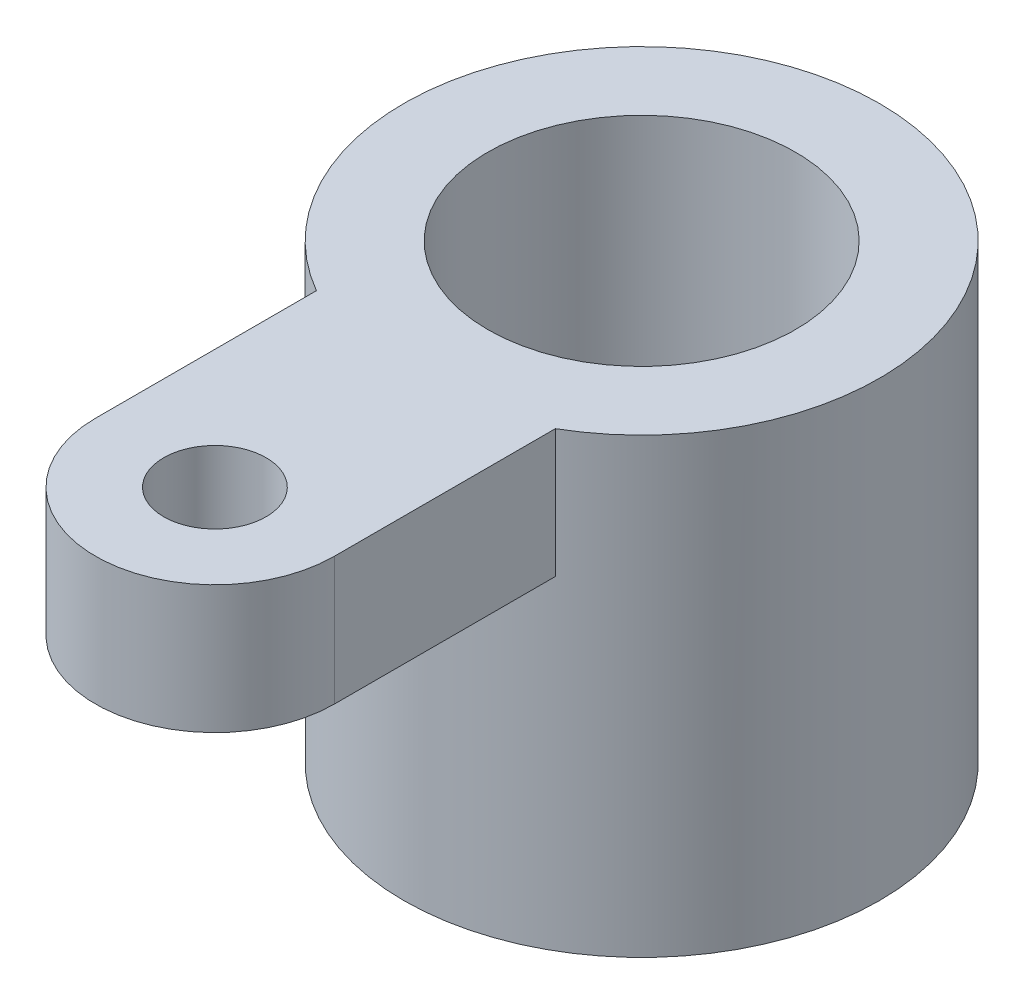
ISO-10303-21;
HEADER;
FILE_DESCRIPTION(('STEP AP214'),'2;1');
FILE_NAME('part.step','',(''),(''),'','','');
FILE_SCHEMA(('AUTOMOTIVE_DESIGN { 1 0 10303 214 1 1 1 1 }'));
ENDSEC;
DATA;
#1=APPLICATION_CONTEXT('core data for automotive mechanical design processes');
#2=APPLICATION_PROTOCOL_DEFINITION('international standard','automotive_design',2000,#1);
#3=PRODUCT_CONTEXT('',#1,'mechanical');
#4=PRODUCT('Part','Part','',(#3));
#5=PRODUCT_RELATED_PRODUCT_CATEGORY('part','',(#4));
#6=PRODUCT_DEFINITION_FORMATION('','',#4);
#7=PRODUCT_DEFINITION_CONTEXT('part definition',#1,'design');
#8=PRODUCT_DEFINITION('design','',#6,#7);
#9=PRODUCT_DEFINITION_SHAPE('','',#8);
#10=(LENGTH_UNIT() NAMED_UNIT(*) SI_UNIT(.MILLI.,.METRE.));
#11=(NAMED_UNIT(*) PLANE_ANGLE_UNIT() SI_UNIT($,.RADIAN.));
#12=(NAMED_UNIT(*) SI_UNIT($,.STERADIAN.) SOLID_ANGLE_UNIT());
#13=UNCERTAINTY_MEASURE_WITH_UNIT(LENGTH_MEASURE(1.E-05),#10,'distance_accuracy_value','');
#14=(GEOMETRIC_REPRESENTATION_CONTEXT(3) GLOBAL_UNCERTAINTY_ASSIGNED_CONTEXT((#13)) GLOBAL_UNIT_ASSIGNED_CONTEXT((#10,
#11,#12)) REPRESENTATION_CONTEXT('',''));
#15=CARTESIAN_POINT('',(0.,0.,0.));
#16=DIRECTION('',(0.,0.,1.));
#17=DIRECTION('',(1.,0.,0.));
#18=AXIS2_PLACEMENT_3D('',#15,#16,#17);
#19=CARTESIAN_POINT('',(0.,-53.,0.));
#20=DIRECTION('',(0.,1.,0.));
#21=DIRECTION('',(0.,0.,1.));
#22=AXIS2_PLACEMENT_3D('',#19,#20,#21);
#23=CYLINDRICAL_SURFACE('',#22,27.8802337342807);
#24=DIRECTION('',(0.,1.,0.));
#25=VECTOR('',#24,1.);
#26=CARTESIAN_POINT('',(-14.,-15.,24.1103179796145));
#27=LINE('',#26,#25);
#28=CARTESIAN_POINT('',(-14.,-15.,24.1103179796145));
#29=VERTEX_POINT('',#28);
#30=CARTESIAN_POINT('',(-14.,0.,24.1103179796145));
#31=VERTEX_POINT('',#30);
#32=EDGE_CURVE('E94',#29,#31,#27,.T.);
#33=ORIENTED_EDGE('',*,*,#32,.T.);
#34=CARTESIAN_POINT('',(0.,0.,0.));
#35=DIRECTION('',(0.,1.,0.));
#36=DIRECTION('',(0.,0.,1.));
#37=AXIS2_PLACEMENT_3D('',#34,#35,#36);
#38=CIRCLE('',#37,27.8802337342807);
#39=CARTESIAN_POINT('',(14.,0.,24.1103179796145));
#40=VERTEX_POINT('',#39);
#41=EDGE_CURVE('E34',#40,#31,#38,.T.);
#42=ORIENTED_EDGE('',*,*,#41,.F.);
#43=DIRECTION('',(0.,1.,0.));
#44=VECTOR('',#43,1.);
#45=CARTESIAN_POINT('',(14.,-15.,24.1103179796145));
#46=LINE('',#45,#44);
#47=CARTESIAN_POINT('',(14.,-15.,24.1103179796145));
#48=VERTEX_POINT('',#47);
#49=EDGE_CURVE('E89',#48,#40,#46,.T.);
#50=ORIENTED_EDGE('',*,*,#49,.F.);
#51=CARTESIAN_POINT('',(0.,-15.,0.));
#52=DIRECTION('',(0.,-1.,0.));
#53=DIRECTION('',(0.,0.,1.));
#54=AXIS2_PLACEMENT_3D('',#51,#52,#53);
#55=CIRCLE('',#54,27.8802337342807);
#56=EDGE_CURVE('E80',#48,#29,#55,.T.);
#57=ORIENTED_EDGE('',*,*,#56,.T.);
#58=EDGE_LOOP('',(#33,#42,#50,#57));
#59=FACE_BOUND('',#58,.T.);
#60=CARTESIAN_POINT('',(0.,-53.,0.));
#61=DIRECTION('',(0.,1.,0.));
#62=DIRECTION('',(0.,0.,1.));
#63=AXIS2_PLACEMENT_3D('',#60,#61,#62);
#64=CIRCLE('',#63,27.8802337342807);
#65=CARTESIAN_POINT('',(0.,-53.,27.8802337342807));
#66=VERTEX_POINT('',#65);
#67=EDGE_CURVE('E11',#66,#66,#64,.T.);
#68=ORIENTED_EDGE('',*,*,#67,.T.);
#69=EDGE_LOOP('',(#68));
#70=FACE_BOUND('',#69,.T.);
#71=ADVANCED_FACE('F31',(#59,#70),#23,.T.);
#72=CARTESIAN_POINT('',(0.,-53.,0.));
#73=DIRECTION('',(0.,1.,0.));
#74=DIRECTION('',(0.,0.,1.));
#75=AXIS2_PLACEMENT_3D('',#72,#73,#74);
#76=PLANE('',#75);
#77=CARTESIAN_POINT('',(0.,-53.,0.));
#78=DIRECTION('',(0.,1.,0.));
#79=DIRECTION('',(0.,0.,1.));
#80=AXIS2_PLACEMENT_3D('',#77,#78,#79);
#81=CIRCLE('',#80,18.0230587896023);
#82=CARTESIAN_POINT('',(0.,-53.,18.0230587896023));
#83=VERTEX_POINT('',#82);
#84=EDGE_CURVE('E100',#83,#83,#81,.T.);
#85=ORIENTED_EDGE('',*,*,#84,.T.);
#86=EDGE_LOOP('',(#85));
#87=FACE_BOUND('',#86,.T.);
#88=ORIENTED_EDGE('',*,*,#67,.F.);
#89=EDGE_LOOP('',(#88));
#90=FACE_BOUND('',#89,.T.);
#91=ADVANCED_FACE('F133',(#87,#90),#76,.F.);
#92=CARTESIAN_POINT('',(0.,0.,0.));
#93=DIRECTION('',(0.,1.,0.));
#94=DIRECTION('',(0.,0.,1.));
#95=AXIS2_PLACEMENT_3D('',#92,#93,#94);
#96=PLANE('',#95);
#97=CARTESIAN_POINT('',(0.,0.,0.));
#98=DIRECTION('',(0.,1.,0.));
#99=DIRECTION('',(0.,0.,1.));
#100=AXIS2_PLACEMENT_3D('',#97,#98,#99);
#101=CIRCLE('',#100,18.0230587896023);
#102=CARTESIAN_POINT('',(0.,0.,18.0230587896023));
#103=VERTEX_POINT('',#102);
#104=EDGE_CURVE('E103',#103,#103,#101,.T.);
#105=ORIENTED_EDGE('',*,*,#104,.F.);
#106=EDGE_LOOP('',(#105));
#107=FACE_BOUND('',#106,.T.);
#108=ORIENTED_EDGE('',*,*,#41,.T.);
#109=DIRECTION('',(0.,0.,1.));
#110=VECTOR('',#109,1.);
#111=CARTESIAN_POINT('',(-14.,0.,50.));
#112=LINE('',#111,#110);
#113=CARTESIAN_POINT('',(-14.,0.,50.));
#114=VERTEX_POINT('',#113);
#115=EDGE_CURVE('E108',#31,#114,#112,.T.);
#116=ORIENTED_EDGE('',*,*,#115,.T.);
#117=CARTESIAN_POINT('',(0.,0.,50.));
#118=DIRECTION('',(0.,1.,0.));
#119=DIRECTION('',(0.,0.,1.));
#120=AXIS2_PLACEMENT_3D('',#117,#118,#119);
#121=CIRCLE('',#120,14.);
#122=CARTESIAN_POINT('',(14.,0.,50.));
#123=VERTEX_POINT('',#122);
#124=EDGE_CURVE('E112',#114,#123,#121,.T.);
#125=ORIENTED_EDGE('',*,*,#124,.T.);
#126=DIRECTION('',(0.,0.,-1.));
#127=VECTOR('',#126,1.);
#128=CARTESIAN_POINT('',(14.,0.,50.));
#129=LINE('',#128,#127);
#130=EDGE_CURVE('E45',#123,#40,#129,.T.);
#131=ORIENTED_EDGE('',*,*,#130,.T.);
#132=EDGE_LOOP('',(#108,#116,#125,#131));
#133=FACE_BOUND('',#132,.T.);
#134=CARTESIAN_POINT('',(0.,0.,50.));
#135=DIRECTION('',(0.,1.,0.));
#136=DIRECTION('',(0.,0.,1.));
#137=AXIS2_PLACEMENT_3D('',#134,#135,#136);
#138=CIRCLE('',#137,6.);
#139=CARTESIAN_POINT('',(0.,0.,56.));
#140=VERTEX_POINT('',#139);
#141=EDGE_CURVE('E117',#140,#140,#138,.T.);
#142=ORIENTED_EDGE('',*,*,#141,.F.);
#143=EDGE_LOOP('',(#142));
#144=FACE_BOUND('',#143,.T.);
#145=ADVANCED_FACE('F130',(#107,#133,#144),#96,.T.);
#146=CARTESIAN_POINT('',(0.,-53.,0.));
#147=DIRECTION('',(0.,1.,0.));
#148=DIRECTION('',(0.,0.,1.));
#149=AXIS2_PLACEMENT_3D('',#146,#147,#148);
#150=CYLINDRICAL_SURFACE('',#149,18.0230587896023);
#151=ORIENTED_EDGE('',*,*,#84,.F.);
#152=EDGE_LOOP('',(#151));
#153=FACE_BOUND('',#152,.T.);
#154=ORIENTED_EDGE('',*,*,#104,.T.);
#155=EDGE_LOOP('',(#154));
#156=FACE_BOUND('',#155,.T.);
#157=ADVANCED_FACE('F132',(#153,#156),#150,.F.);
#158=CARTESIAN_POINT('',(0.,-15.,50.));
#159=DIRECTION('',(0.,1.,0.));
#160=DIRECTION('',(0.,0.,1.));
#161=AXIS2_PLACEMENT_3D('',#158,#159,#160);
#162=CYLINDRICAL_SURFACE('',#161,14.);
#163=ORIENTED_EDGE('',*,*,#124,.F.);
#164=DIRECTION('',(0.,1.,0.));
#165=VECTOR('',#164,1.);
#166=CARTESIAN_POINT('',(-14.,-15.,50.));
#167=LINE('',#166,#165);
#168=CARTESIAN_POINT('',(-14.,-15.,50.));
#169=VERTEX_POINT('',#168);
#170=EDGE_CURVE('E54',#169,#114,#167,.T.);
#171=ORIENTED_EDGE('',*,*,#170,.F.);
#172=CARTESIAN_POINT('',(0.,-15.,50.));
#173=DIRECTION('',(0.,1.,0.));
#174=DIRECTION('',(0.,0.,1.));
#175=AXIS2_PLACEMENT_3D('',#172,#173,#174);
#176=CIRCLE('',#175,14.);
#177=CARTESIAN_POINT('',(14.,-15.,50.));
#178=VERTEX_POINT('',#177);
#179=EDGE_CURVE('E91',#169,#178,#176,.T.);
#180=ORIENTED_EDGE('',*,*,#179,.T.);
#181=DIRECTION('',(0.,1.,0.));
#182=VECTOR('',#181,1.);
#183=CARTESIAN_POINT('',(14.,-15.,50.));
#184=LINE('',#183,#182);
#185=EDGE_CURVE('E74',#178,#123,#184,.T.);
#186=ORIENTED_EDGE('',*,*,#185,.T.);
#187=EDGE_LOOP('',(#163,#171,#180,#186));
#188=FACE_BOUND('',#187,.T.);
#189=ADVANCED_FACE('F139',(#188),#162,.T.);
#190=CARTESIAN_POINT('',(-14.,-15.,50.));
#191=DIRECTION('',(-1.,0.,0.));
#192=DIRECTION('',(0.,0.,1.));
#193=AXIS2_PLACEMENT_3D('',#190,#191,#192);
#194=PLANE('',#193);
#195=ORIENTED_EDGE('',*,*,#115,.F.);
#196=ORIENTED_EDGE('',*,*,#32,.F.);
#197=DIRECTION('',(0.,0.,1.));
#198=VECTOR('',#197,1.);
#199=CARTESIAN_POINT('',(-14.,-15.,50.));
#200=LINE('',#199,#198);
#201=EDGE_CURVE('E83',#29,#169,#200,.T.);
#202=ORIENTED_EDGE('',*,*,#201,.T.);
#203=ORIENTED_EDGE('',*,*,#170,.T.);
#204=EDGE_LOOP('',(#195,#196,#202,#203));
#205=FACE_BOUND('',#204,.T.);
#206=ADVANCED_FACE('F163',(#205),#194,.T.);
#207=CARTESIAN_POINT('',(14.,-15.,50.));
#208=DIRECTION('',(1.,0.,0.));
#209=DIRECTION('',(0.,0.,-1.));
#210=AXIS2_PLACEMENT_3D('',#207,#208,#209);
#211=PLANE('',#210);
#212=ORIENTED_EDGE('',*,*,#130,.F.);
#213=ORIENTED_EDGE('',*,*,#185,.F.);
#214=DIRECTION('',(0.,0.,-1.));
#215=VECTOR('',#214,1.);
#216=CARTESIAN_POINT('',(14.,-15.,50.));
#217=LINE('',#216,#215);
#218=EDGE_CURVE('E82',#178,#48,#217,.T.);
#219=ORIENTED_EDGE('',*,*,#218,.T.);
#220=ORIENTED_EDGE('',*,*,#49,.T.);
#221=EDGE_LOOP('',(#212,#213,#219,#220));
#222=FACE_BOUND('',#221,.T.);
#223=ADVANCED_FACE('F88',(#222),#211,.T.);
#224=CARTESIAN_POINT('',(0.,-15.,50.));
#225=DIRECTION('',(0.,1.,0.));
#226=DIRECTION('',(0.,0.,1.));
#227=AXIS2_PLACEMENT_3D('',#224,#225,#226);
#228=PLANE('',#227);
#229=CARTESIAN_POINT('',(0.,-15.,50.));
#230=DIRECTION('',(0.,1.,0.));
#231=DIRECTION('',(0.,0.,1.));
#232=AXIS2_PLACEMENT_3D('',#229,#230,#231);
#233=CIRCLE('',#232,6.);
#234=CARTESIAN_POINT('',(0.,-15.,56.));
#235=VERTEX_POINT('',#234);
#236=EDGE_CURVE('E114',#235,#235,#233,.T.);
#237=ORIENTED_EDGE('',*,*,#236,.T.);
#238=EDGE_LOOP('',(#237));
#239=FACE_BOUND('',#238,.T.);
#240=ORIENTED_EDGE('',*,*,#179,.F.);
#241=ORIENTED_EDGE('',*,*,#201,.F.);
#242=ORIENTED_EDGE('',*,*,#56,.F.);
#243=ORIENTED_EDGE('',*,*,#218,.F.);
#244=EDGE_LOOP('',(#240,#241,#242,#243));
#245=FACE_BOUND('',#244,.T.);
#246=ADVANCED_FACE('F81',(#239,#245),#228,.F.);
#247=CARTESIAN_POINT('',(0.,-15.,50.));
#248=DIRECTION('',(0.,1.,0.));
#249=DIRECTION('',(0.,0.,1.));
#250=AXIS2_PLACEMENT_3D('',#247,#248,#249);
#251=CYLINDRICAL_SURFACE('',#250,6.);
#252=ORIENTED_EDGE('',*,*,#236,.F.);
#253=EDGE_LOOP('',(#252));
#254=FACE_BOUND('',#253,.T.);
#255=ORIENTED_EDGE('',*,*,#141,.T.);
#256=EDGE_LOOP('',(#255));
#257=FACE_BOUND('',#256,.T.);
#258=ADVANCED_FACE('F124',(#254,#257),#251,.F.);
#259=CLOSED_SHELL('',(#71,#91,#145,#157,#189,#206,#223,#246,#258));
#260=MANIFOLD_SOLID_BREP('B2',#259);
#261=ADVANCED_BREP_SHAPE_REPRESENTATION('',(#18,#260),#14);
#262=SHAPE_DEFINITION_REPRESENTATION(#9,#261);
ENDSEC;
END-ISO-10303-21;
